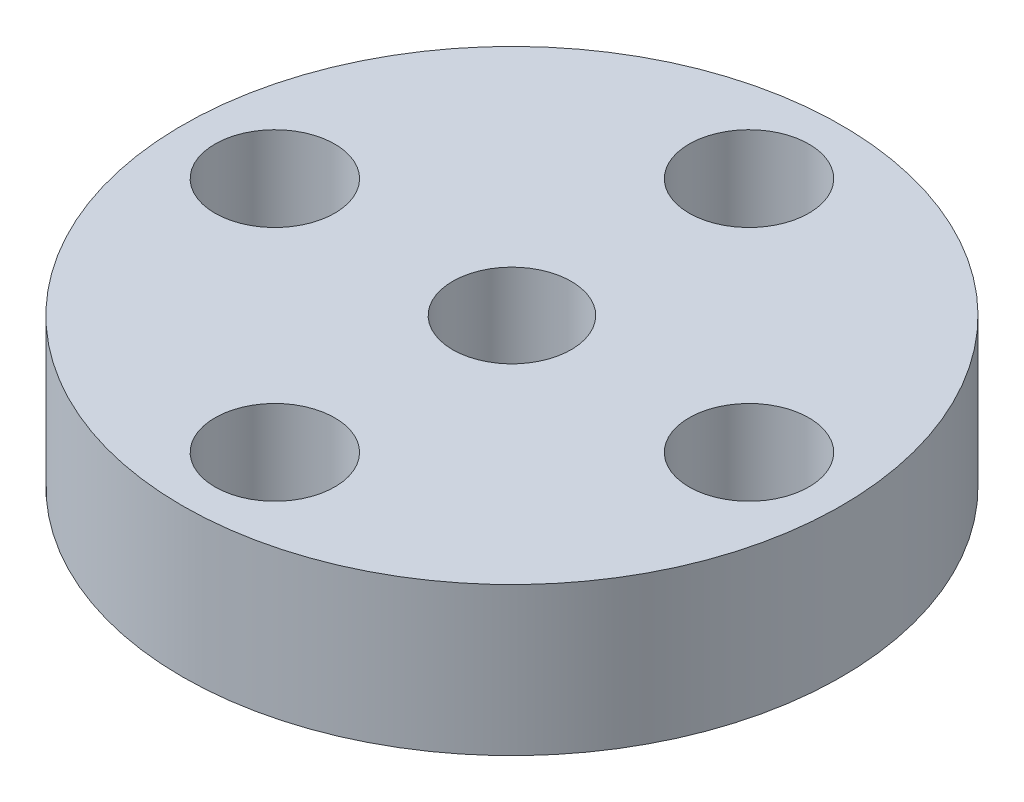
from build123d import *

# Parameters (mm, degrees)
SKETCH_1_R      = 11.121161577
SKETCH_1_R_2    = 2.022029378
SKETCH_1_R_3    = 2
EXTRUDE_1_DEPTH = 5


with BuildPart() as part:
    # Sketch 1 → Extrude 1 (new body)
    with BuildSketch(Plane(origin=(0, 0, 0), x_dir=(1, 0, 0), z_dir=(0, 1, 0))):
        with Locations(Location((-25.996689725, 13.762953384, 0), (0, 0, 270))):
            Circle(SKETCH_1_R)
        with Locations(Location((-33.996689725, 13.762953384, 0), (0, 0, 270))):
            Circle(SKETCH_1_R_2, mode=Mode.SUBTRACT)
        with Locations(Location((-17.996689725, 13.762953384, 0), (0, 0, 270))):
            Circle(SKETCH_1_R_2, mode=Mode.SUBTRACT)
        with Locations(Location((-25.996689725, 21.762953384, 0), (0, 0, 270))):
            Circle(SKETCH_1_R_2, mode=Mode.SUBTRACT)
        with Locations(Location((-25.996689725, 5.762953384, 0), (0, 0, 270))):
            Circle(SKETCH_1_R_2, mode=Mode.SUBTRACT)
        with Locations(Location((-25.996689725, 13.762953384, 0), (0, 0, 270))):
            Circle(SKETCH_1_R_3, mode=Mode.SUBTRACT)
    extrude(amount=EXTRUDE_1_DEPTH)


solid = part.part
